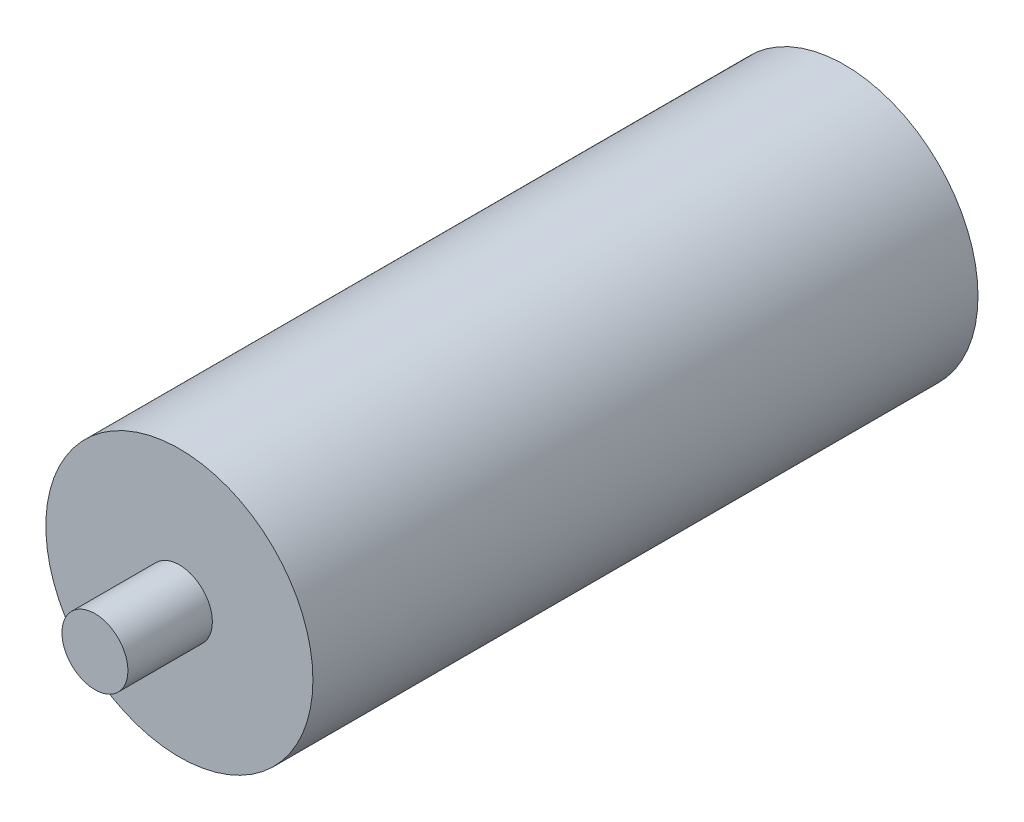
from build123d import *

# Parameters (mm, degrees)
SKETCH1_R           = 32.131
BOSS_EXTRUDE1_DEPTH = 160.02
SKETCH2_R           = 7.9375
BOSS_EXTRUDE2_DEPTH = 20.32


with BuildPart() as part:
    # Sketch1 → Boss-Extrude1 (new body)
    with BuildSketch(Plane.XY):
        Circle(SKETCH1_R)
    extrude(amount=BOSS_EXTRUDE1_DEPTH)

    # Sketch2 → Boss-Extrude2 (add)
    with BuildSketch(Plane.XY.offset(160.02)):
        Circle(SKETCH2_R)
    extrude(amount=BOSS_EXTRUDE2_DEPTH)


solid = part.part
